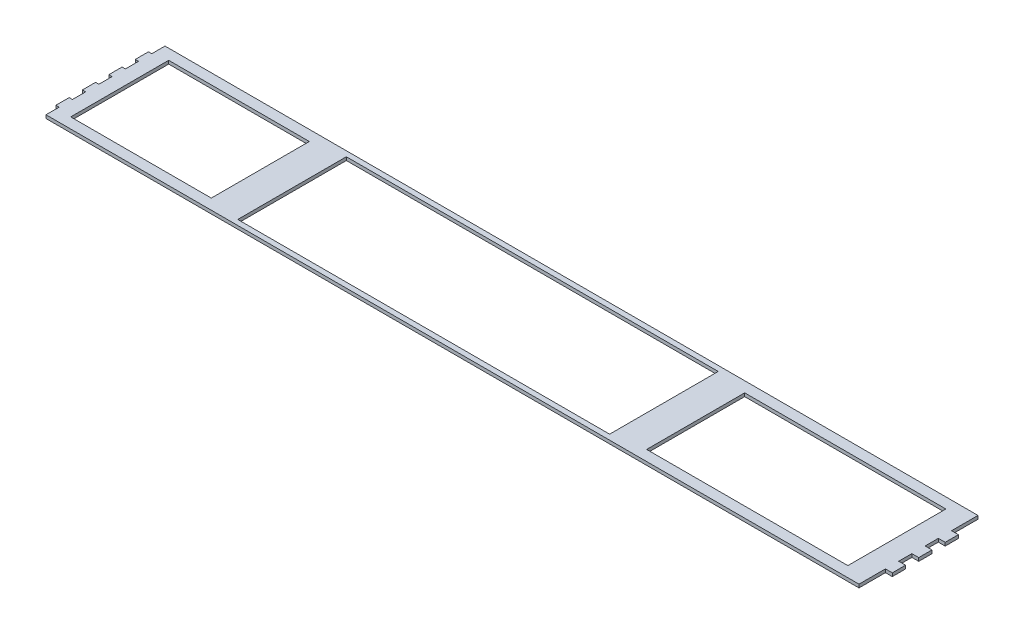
ISO-10303-21;
HEADER;
FILE_DESCRIPTION(('STEP AP214'),'2;1');
FILE_NAME('part.step','',(''),(''),'','','');
FILE_SCHEMA(('AUTOMOTIVE_DESIGN { 1 0 10303 214 1 1 1 1 }'));
ENDSEC;
DATA;
#1=APPLICATION_CONTEXT('core data for automotive mechanical design processes');
#2=APPLICATION_PROTOCOL_DEFINITION('international standard','automotive_design',2000,#1);
#3=PRODUCT_CONTEXT('',#1,'mechanical');
#4=PRODUCT('Part','Part','',(#3));
#5=PRODUCT_RELATED_PRODUCT_CATEGORY('part','',(#4));
#6=PRODUCT_DEFINITION_FORMATION('','',#4);
#7=PRODUCT_DEFINITION_CONTEXT('part definition',#1,'design');
#8=PRODUCT_DEFINITION('design','',#6,#7);
#9=PRODUCT_DEFINITION_SHAPE('','',#8);
#10=(LENGTH_UNIT() NAMED_UNIT(*) SI_UNIT(.MILLI.,.METRE.));
#11=(NAMED_UNIT(*) PLANE_ANGLE_UNIT() SI_UNIT($,.RADIAN.));
#12=(NAMED_UNIT(*) SI_UNIT($,.STERADIAN.) SOLID_ANGLE_UNIT());
#13=UNCERTAINTY_MEASURE_WITH_UNIT(LENGTH_MEASURE(1.E-05),#10,'distance_accuracy_value','');
#14=(GEOMETRIC_REPRESENTATION_CONTEXT(3) GLOBAL_UNCERTAINTY_ASSIGNED_CONTEXT((#13)) GLOBAL_UNIT_ASSIGNED_CONTEXT((#10,
#11,#12)) REPRESENTATION_CONTEXT('',''));
#15=CARTESIAN_POINT('',(0.,0.,0.));
#16=DIRECTION('',(0.,0.,1.));
#17=DIRECTION('',(1.,0.,0.));
#18=AXIS2_PLACEMENT_3D('',#15,#16,#17);
#19=CARTESIAN_POINT('',(0.,51.6603075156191,52.1499998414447));
#20=DIRECTION('',(0.,0.,1.));
#21=DIRECTION('',(1.,0.,0.));
#22=AXIS2_PLACEMENT_3D('',#19,#20,#21);
#23=PLANE('',#22);
#24=DIRECTION('',(0.,1.,0.));
#25=VECTOR('',#24,1.);
#26=CARTESIAN_POINT('',(463.063757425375,-53.8629577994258,52.1500001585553));
#27=LINE('',#26,#25);
#28=CARTESIAN_POINT('',(463.063757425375,53.4853075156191,52.1500001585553));
#29=VERTEX_POINT('',#28);
#30=CARTESIAN_POINT('',(463.063757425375,56.6603075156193,52.1500001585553));
#31=VERTEX_POINT('',#30);
#32=EDGE_CURVE('E1356',#29,#31,#27,.T.);
#33=ORIENTED_EDGE('',*,*,#32,.F.);
#34=DIRECTION('',(1.,0.,0.));
#35=VECTOR('',#34,1.);
#36=CARTESIAN_POINT('',(0.,53.4853075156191,52.1499998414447));
#37=LINE('',#36,#35);
#38=CARTESIAN_POINT('',(105.913757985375,53.4853075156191,52.1499998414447));
#39=VERTEX_POINT('',#38);
#40=EDGE_CURVE('E1636',#39,#29,#37,.T.);
#41=ORIENTED_EDGE('',*,*,#40,.F.);
#42=DIRECTION('',(0.,1.,0.));
#43=VECTOR('',#42,1.);
#44=CARTESIAN_POINT('',(105.913757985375,-53.8629577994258,52.1499998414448));
#45=LINE('',#44,#43);
#46=CARTESIAN_POINT('',(105.913757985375,56.6603075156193,52.1499998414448));
#47=VERTEX_POINT('',#46);
#48=EDGE_CURVE('E1419',#39,#47,#45,.T.);
#49=ORIENTED_EDGE('',*,*,#48,.T.);
#50=DIRECTION('',(-1.,0.,0.));
#51=VECTOR('',#50,1.);
#52=CARTESIAN_POINT('',(-76.4112418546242,56.6603075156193,52.1499998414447));
#53=LINE('',#52,#51);
#54=EDGE_CURVE('E1642',#31,#47,#53,.T.);
#55=ORIENTED_EDGE('',*,*,#54,.F.);
#56=EDGE_LOOP('',(#33,#41,#49,#55));
#57=FACE_BOUND('',#56,.T.);
#58=ADVANCED_FACE('F1065',(#57),#23,.F.);
#59=CARTESIAN_POINT('',(0.,51.6603075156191,-52.1500001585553));
#60=DIRECTION('',(0.,0.,1.));
#61=DIRECTION('',(1.,0.,0.));
#62=AXIS2_PLACEMENT_3D('',#59,#60,#61);
#63=PLANE('',#62);
#64=DIRECTION('',(1.,0.,0.));
#65=VECTOR('',#64,1.);
#66=CARTESIAN_POINT('',(0.,53.4853075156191,-52.1500001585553));
#67=LINE('',#66,#65);
#68=CARTESIAN_POINT('',(105.913757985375,53.4853075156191,-52.1500001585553));
#69=VERTEX_POINT('',#68);
#70=CARTESIAN_POINT('',(463.063757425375,53.4853075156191,-52.1500001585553));
#71=VERTEX_POINT('',#70);
#72=EDGE_CURVE('E1633',#69,#71,#67,.T.);
#73=ORIENTED_EDGE('',*,*,#72,.T.);
#74=DIRECTION('',(0.,1.,0.));
#75=VECTOR('',#74,1.);
#76=CARTESIAN_POINT('',(463.063757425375,-53.8629577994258,-52.1500001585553));
#77=LINE('',#76,#75);
#78=CARTESIAN_POINT('',(463.063757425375,56.6603075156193,-52.1500001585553));
#79=VERTEX_POINT('',#78);
#80=EDGE_CURVE('E1412',#71,#79,#77,.T.);
#81=ORIENTED_EDGE('',*,*,#80,.T.);
#82=DIRECTION('',(-1.,0.,0.));
#83=VECTOR('',#82,1.);
#84=CARTESIAN_POINT('',(-76.4112418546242,56.6603075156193,-52.1500001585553));
#85=LINE('',#84,#83);
#86=CARTESIAN_POINT('',(105.913757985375,56.6603075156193,-52.1500001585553));
#87=VERTEX_POINT('',#86);
#88=EDGE_CURVE('E1639',#79,#87,#85,.T.);
#89=ORIENTED_EDGE('',*,*,#88,.T.);
#90=DIRECTION('',(0.,1.,0.));
#91=VECTOR('',#90,1.);
#92=CARTESIAN_POINT('',(105.913757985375,-53.8629577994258,-52.1500001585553));
#93=LINE('',#92,#91);
#94=EDGE_CURVE('E1421',#69,#87,#93,.T.);
#95=ORIENTED_EDGE('',*,*,#94,.F.);
#96=EDGE_LOOP('',(#73,#81,#89,#95));
#97=FACE_BOUND('',#96,.T.);
#98=ADVANCED_FACE('F1921',(#97),#63,.T.);
#99=CARTESIAN_POINT('',(0.,53.4853075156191,31.7500001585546));
#100=DIRECTION('',(0.,0.,1.));
#101=DIRECTION('',(1.,0.,0.));
#102=AXIS2_PLACEMENT_3D('',#99,#100,#101);
#103=PLANE('',#102);
#104=DIRECTION('',(-1.,0.,0.));
#105=VECTOR('',#104,1.);
#106=CARTESIAN_POINT('',(-76.4112418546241,56.6603075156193,31.7500001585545));
#107=LINE('',#106,#105);
#108=CARTESIAN_POINT('',(714.140524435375,56.6603075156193,31.7500001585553));
#109=VERTEX_POINT('',#108);
#110=CARTESIAN_POINT('',(707.550474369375,56.6603075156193,31.7500001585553));
#111=VERTEX_POINT('',#110);
#112=EDGE_CURVE('E1564',#109,#111,#107,.T.);
#113=ORIENTED_EDGE('',*,*,#112,.T.);
#114=DIRECTION('',(0.,1.,0.));
#115=VECTOR('',#114,1.);
#116=CARTESIAN_POINT('',(707.550474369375,53.4853075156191,31.7500001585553));
#117=LINE('',#116,#115);
#118=CARTESIAN_POINT('',(707.550474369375,53.4853075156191,31.7500001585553));
#119=VERTEX_POINT('',#118);
#120=EDGE_CURVE('E1475',#119,#111,#117,.T.);
#121=ORIENTED_EDGE('',*,*,#120,.F.);
#122=DIRECTION('',(1.,0.,0.));
#123=VECTOR('',#122,1.);
#124=CARTESIAN_POINT('',(0.,53.4853075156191,31.7500001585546));
#125=LINE('',#124,#123);
#126=CARTESIAN_POINT('',(714.140524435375,53.4853075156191,31.7500001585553));
#127=VERTEX_POINT('',#126);
#128=EDGE_CURVE('E1462',#119,#127,#125,.T.);
#129=ORIENTED_EDGE('',*,*,#128,.T.);
#130=DIRECTION('',(0.,1.,0.));
#131=VECTOR('',#130,1.);
#132=CARTESIAN_POINT('',(714.140524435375,53.4853075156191,31.7500001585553));
#133=LINE('',#132,#131);
#134=EDGE_CURVE('E1479',#127,#109,#133,.T.);
#135=ORIENTED_EDGE('',*,*,#134,.T.);
#136=EDGE_LOOP('',(#113,#121,#129,#135));
#137=FACE_BOUND('',#136,.T.);
#138=ADVANCED_FACE('F1879',(#137),#103,.T.);
#139=CARTESIAN_POINT('',(714.140524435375,53.4853075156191,0.));
#140=DIRECTION('',(-1.,0.,0.));
#141=DIRECTION('',(0.,0.,1.));
#142=AXIS2_PLACEMENT_3D('',#139,#140,#141);
#143=PLANE('',#142);
#144=ORIENTED_EDGE('',*,*,#134,.F.);
#145=DIRECTION('',(0.,0.,1.));
#146=VECTOR('',#145,1.);
#147=CARTESIAN_POINT('',(714.140524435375,53.4853075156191,0.));
#148=LINE('',#147,#146);
#149=CARTESIAN_POINT('',(714.140524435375,53.4853075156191,19.0500000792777));
#150=VERTEX_POINT('',#149);
#151=EDGE_CURVE('E1439',#150,#127,#148,.T.);
#152=ORIENTED_EDGE('',*,*,#151,.F.);
#153=DIRECTION('',(0.,1.,0.));
#154=VECTOR('',#153,1.);
#155=CARTESIAN_POINT('',(714.140524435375,53.4853075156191,19.0500000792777));
#156=LINE('',#155,#154);
#157=CARTESIAN_POINT('',(714.140524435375,56.6603075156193,19.0500000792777));
#158=VERTEX_POINT('',#157);
#159=EDGE_CURVE('E1483',#150,#158,#156,.T.);
#160=ORIENTED_EDGE('',*,*,#159,.T.);
#161=DIRECTION('',(0.,0.,-1.));
#162=VECTOR('',#161,1.);
#163=CARTESIAN_POINT('',(714.140524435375,56.6603075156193,57.1499998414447));
#164=LINE('',#163,#162);
#165=EDGE_CURVE('E1560',#109,#158,#164,.T.);
#166=ORIENTED_EDGE('',*,*,#165,.F.);
#167=EDGE_LOOP('',(#144,#152,#160,#166));
#168=FACE_BOUND('',#167,.T.);
#169=ADVANCED_FACE('F1876',(#168),#143,.F.);
#170=CARTESIAN_POINT('',(0.,53.4853075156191,19.0500000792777));
#171=DIRECTION('',(0.,0.,1.));
#172=DIRECTION('',(1.,0.,0.));
#173=AXIS2_PLACEMENT_3D('',#170,#171,#172);
#174=PLANE('',#173);
#175=ORIENTED_EDGE('',*,*,#159,.F.);
#176=DIRECTION('',(1.,0.,0.));
#177=VECTOR('',#176,1.);
#178=CARTESIAN_POINT('',(0.,53.4853075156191,19.0500000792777));
#179=LINE('',#178,#177);
#180=CARTESIAN_POINT('',(707.550474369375,53.4853075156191,19.0500000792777));
#181=VERTEX_POINT('',#180);
#182=EDGE_CURVE('E1458',#181,#150,#179,.T.);
#183=ORIENTED_EDGE('',*,*,#182,.F.);
#184=DIRECTION('',(0.,1.,0.));
#185=VECTOR('',#184,1.);
#186=CARTESIAN_POINT('',(707.550474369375,53.4853075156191,19.0500000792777));
#187=LINE('',#186,#185);
#188=CARTESIAN_POINT('',(707.550474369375,56.6603075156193,19.0500000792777));
#189=VERTEX_POINT('',#188);
#190=EDGE_CURVE('E1487',#181,#189,#187,.T.);
#191=ORIENTED_EDGE('',*,*,#190,.T.);
#192=DIRECTION('',(-1.,0.,0.));
#193=VECTOR('',#192,1.);
#194=CARTESIAN_POINT('',(-76.4112418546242,56.6603075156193,19.0500000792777));
#195=LINE('',#194,#193);
#196=EDGE_CURVE('E1556',#158,#189,#195,.T.);
#197=ORIENTED_EDGE('',*,*,#196,.F.);
#198=EDGE_LOOP('',(#175,#183,#191,#197));
#199=FACE_BOUND('',#198,.T.);
#200=ADVANCED_FACE('F2096',(#199),#174,.F.);
#201=CARTESIAN_POINT('',(707.550474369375,53.4853075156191,0.));
#202=DIRECTION('',(-1.,0.,0.));
#203=DIRECTION('',(0.,0.,1.));
#204=AXIS2_PLACEMENT_3D('',#201,#202,#203);
#205=PLANE('',#204);
#206=ORIENTED_EDGE('',*,*,#190,.F.);
#207=DIRECTION('',(0.,0.,1.));
#208=VECTOR('',#207,1.);
#209=CARTESIAN_POINT('',(707.550474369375,53.4853075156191,0.));
#210=LINE('',#209,#208);
#211=CARTESIAN_POINT('',(707.550474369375,53.4853075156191,6.35));
#212=VERTEX_POINT('',#211);
#213=EDGE_CURVE('E1454',#212,#181,#210,.T.);
#214=ORIENTED_EDGE('',*,*,#213,.F.);
#215=DIRECTION('',(0.,1.,0.));
#216=VECTOR('',#215,1.);
#217=CARTESIAN_POINT('',(707.550474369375,53.4853075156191,6.35));
#218=LINE('',#217,#216);
#219=CARTESIAN_POINT('',(707.550474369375,56.6603075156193,6.35));
#220=VERTEX_POINT('',#219);
#221=EDGE_CURVE('E1491',#212,#220,#218,.T.);
#222=ORIENTED_EDGE('',*,*,#221,.T.);
#223=DIRECTION('',(0.,0.,-1.));
#224=VECTOR('',#223,1.);
#225=CARTESIAN_POINT('',(707.550474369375,56.6603075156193,57.1499998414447));
#226=LINE('',#225,#224);
#227=EDGE_CURVE('E1552',#189,#220,#226,.T.);
#228=ORIENTED_EDGE('',*,*,#227,.F.);
#229=EDGE_LOOP('',(#206,#214,#222,#228));
#230=FACE_BOUND('',#229,.T.);
#231=ADVANCED_FACE('F2106',(#230),#205,.F.);
#232=CARTESIAN_POINT('',(0.,53.4853075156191,6.35));
#233=DIRECTION('',(0.,0.,1.));
#234=DIRECTION('',(1.,0.,0.));
#235=AXIS2_PLACEMENT_3D('',#232,#233,#234);
#236=PLANE('',#235);
#237=DIRECTION('',(-1.,0.,0.));
#238=VECTOR('',#237,1.);
#239=CARTESIAN_POINT('',(-76.4112418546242,56.6603075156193,6.34999999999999));
#240=LINE('',#239,#238);
#241=CARTESIAN_POINT('',(714.140524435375,56.6603075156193,6.35));
#242=VERTEX_POINT('',#241);
#243=EDGE_CURVE('E1549',#242,#220,#240,.T.);
#244=ORIENTED_EDGE('',*,*,#243,.T.);
#245=ORIENTED_EDGE('',*,*,#221,.F.);
#246=DIRECTION('',(1.,0.,0.));
#247=VECTOR('',#246,1.);
#248=CARTESIAN_POINT('',(0.,53.4853075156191,6.35));
#249=LINE('',#248,#247);
#250=CARTESIAN_POINT('',(714.140524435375,53.4853075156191,6.35));
#251=VERTEX_POINT('',#250);
#252=EDGE_CURVE('E1451',#212,#251,#249,.T.);
#253=ORIENTED_EDGE('',*,*,#252,.T.);
#254=DIRECTION('',(0.,1.,0.));
#255=VECTOR('',#254,1.);
#256=CARTESIAN_POINT('',(714.140524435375,53.4853075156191,6.35));
#257=LINE('',#256,#255);
#258=EDGE_CURVE('E1495',#251,#242,#257,.T.);
#259=ORIENTED_EDGE('',*,*,#258,.T.);
#260=EDGE_LOOP('',(#244,#245,#253,#259));
#261=FACE_BOUND('',#260,.T.);
#262=ADVANCED_FACE('F2114',(#261),#236,.T.);
#263=ORIENTED_EDGE('',*,*,#258,.F.);
#264=CARTESIAN_POINT('',(714.140524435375,53.4853075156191,-6.35000007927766));
#265=VERTEX_POINT('',#264);
#266=EDGE_CURVE('E1440',#265,#251,#148,.T.);
#267=ORIENTED_EDGE('',*,*,#266,.F.);
#268=DIRECTION('',(0.,1.,0.));
#269=VECTOR('',#268,1.);
#270=CARTESIAN_POINT('',(714.140524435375,53.4853075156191,-6.35000007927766));
#271=LINE('',#270,#269);
#272=CARTESIAN_POINT('',(714.140524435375,56.6603075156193,-6.35000007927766));
#273=VERTEX_POINT('',#272);
#274=EDGE_CURVE('E1499',#265,#273,#271,.T.);
#275=ORIENTED_EDGE('',*,*,#274,.T.);
#276=DIRECTION('',(0.,0.,-1.));
#277=VECTOR('',#276,1.);
#278=CARTESIAN_POINT('',(714.140524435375,56.6603075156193,57.1499998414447));
#279=LINE('',#278,#277);
#280=EDGE_CURVE('E1545',#242,#273,#279,.T.);
#281=ORIENTED_EDGE('',*,*,#280,.F.);
#282=EDGE_LOOP('',(#263,#267,#275,#281));
#283=FACE_BOUND('',#282,.T.);
#284=ADVANCED_FACE('F2098',(#283),#143,.F.);
#285=CARTESIAN_POINT('',(0.,53.4853075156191,-6.35000007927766));
#286=DIRECTION('',(0.,0.,1.));
#287=DIRECTION('',(1.,0.,0.));
#288=AXIS2_PLACEMENT_3D('',#285,#286,#287);
#289=PLANE('',#288);
#290=ORIENTED_EDGE('',*,*,#274,.F.);
#291=DIRECTION('',(1.,0.,0.));
#292=VECTOR('',#291,1.);
#293=CARTESIAN_POINT('',(0.,53.4853075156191,-6.35000007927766));
#294=LINE('',#293,#292);
#295=CARTESIAN_POINT('',(707.550474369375,53.4853075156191,-6.35000007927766));
#296=VERTEX_POINT('',#295);
#297=EDGE_CURVE('E1447',#296,#265,#294,.T.);
#298=ORIENTED_EDGE('',*,*,#297,.F.);
#299=DIRECTION('',(0.,1.,0.));
#300=VECTOR('',#299,1.);
#301=CARTESIAN_POINT('',(707.550474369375,53.4853075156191,-6.35000007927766));
#302=LINE('',#301,#300);
#303=CARTESIAN_POINT('',(707.550474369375,56.6603075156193,-6.35000007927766));
#304=VERTEX_POINT('',#303);
#305=EDGE_CURVE('E1503',#296,#304,#302,.T.);
#306=ORIENTED_EDGE('',*,*,#305,.T.);
#307=DIRECTION('',(-1.,0.,0.));
#308=VECTOR('',#307,1.);
#309=CARTESIAN_POINT('',(-76.4112418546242,56.6603075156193,-6.35000007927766));
#310=LINE('',#309,#308);
#311=EDGE_CURVE('E1541',#273,#304,#310,.T.);
#312=ORIENTED_EDGE('',*,*,#311,.F.);
#313=EDGE_LOOP('',(#290,#298,#306,#312));
#314=FACE_BOUND('',#313,.T.);
#315=ADVANCED_FACE('F1860',(#314),#289,.F.);
#316=CARTESIAN_POINT('',(707.550474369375,53.4853075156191,0.));
#317=DIRECTION('',(-1.,0.,0.));
#318=DIRECTION('',(0.,0.,1.));
#319=AXIS2_PLACEMENT_3D('',#316,#317,#318);
#320=PLANE('',#319);
#321=ORIENTED_EDGE('',*,*,#305,.F.);
#322=DIRECTION('',(0.,0.,1.));
#323=VECTOR('',#322,1.);
#324=CARTESIAN_POINT('',(707.550474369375,53.4853075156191,0.));
#325=LINE('',#324,#323);
#326=CARTESIAN_POINT('',(707.550474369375,53.4853075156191,-19.0500001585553));
#327=VERTEX_POINT('',#326);
#328=EDGE_CURVE('E1443',#327,#296,#325,.T.);
#329=ORIENTED_EDGE('',*,*,#328,.F.);
#330=DIRECTION('',(0.,1.,0.));
#331=VECTOR('',#330,1.);
#332=CARTESIAN_POINT('',(707.550474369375,53.4853075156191,-19.0500001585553));
#333=LINE('',#332,#331);
#334=CARTESIAN_POINT('',(707.550474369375,56.6603075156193,-19.0500001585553));
#335=VERTEX_POINT('',#334);
#336=EDGE_CURVE('E1507',#327,#335,#333,.T.);
#337=ORIENTED_EDGE('',*,*,#336,.T.);
#338=DIRECTION('',(0.,0.,-1.));
#339=VECTOR('',#338,1.);
#340=CARTESIAN_POINT('',(707.550474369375,56.6603075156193,57.1499998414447));
#341=LINE('',#340,#339);
#342=EDGE_CURVE('E1537',#304,#335,#341,.T.);
#343=ORIENTED_EDGE('',*,*,#342,.F.);
#344=EDGE_LOOP('',(#321,#329,#337,#343));
#345=FACE_BOUND('',#344,.T.);
#346=ADVANCED_FACE('F1857',(#345),#320,.F.);
#347=CARTESIAN_POINT('',(0.,53.4853075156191,-19.0500001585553));
#348=DIRECTION('',(0.,0.,1.));
#349=DIRECTION('',(1.,0.,0.));
#350=AXIS2_PLACEMENT_3D('',#347,#348,#349);
#351=PLANE('',#350);
#352=DIRECTION('',(-1.,0.,0.));
#353=VECTOR('',#352,1.);
#354=CARTESIAN_POINT('',(-76.4112418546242,56.6603075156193,-19.0500001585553));
#355=LINE('',#354,#353);
#356=CARTESIAN_POINT('',(714.140524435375,56.6603075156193,-19.0500001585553));
#357=VERTEX_POINT('',#356);
#358=EDGE_CURVE('E1534',#357,#335,#355,.T.);
#359=ORIENTED_EDGE('',*,*,#358,.T.);
#360=ORIENTED_EDGE('',*,*,#336,.F.);
#361=DIRECTION('',(1.,0.,0.));
#362=VECTOR('',#361,1.);
#363=CARTESIAN_POINT('',(0.,53.4853075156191,-19.0500001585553));
#364=LINE('',#363,#362);
#365=CARTESIAN_POINT('',(714.140524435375,53.4853075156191,-19.0500001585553));
#366=VERTEX_POINT('',#365);
#367=EDGE_CURVE('E1438',#327,#366,#364,.T.);
#368=ORIENTED_EDGE('',*,*,#367,.T.);
#369=DIRECTION('',(0.,1.,0.));
#370=VECTOR('',#369,1.);
#371=CARTESIAN_POINT('',(714.140524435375,53.4853075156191,-19.0500001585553));
#372=LINE('',#371,#370);
#373=EDGE_CURVE('E1511',#366,#357,#372,.T.);
#374=ORIENTED_EDGE('',*,*,#373,.T.);
#375=EDGE_LOOP('',(#359,#360,#368,#374));
#376=FACE_BOUND('',#375,.T.);
#377=ADVANCED_FACE('F1855',(#376),#351,.T.);
#378=ORIENTED_EDGE('',*,*,#373,.F.);
#379=CARTESIAN_POINT('',(714.140524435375,53.4853075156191,-31.7500001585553));
#380=VERTEX_POINT('',#379);
#381=EDGE_CURVE('E1434',#380,#366,#148,.T.);
#382=ORIENTED_EDGE('',*,*,#381,.F.);
#383=DIRECTION('',(0.,1.,0.));
#384=VECTOR('',#383,1.);
#385=CARTESIAN_POINT('',(714.140524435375,53.4853075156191,-31.7500001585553));
#386=LINE('',#385,#384);
#387=CARTESIAN_POINT('',(714.140524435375,56.6603075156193,-31.7500001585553));
#388=VERTEX_POINT('',#387);
#389=EDGE_CURVE('E1515',#380,#388,#386,.T.);
#390=ORIENTED_EDGE('',*,*,#389,.T.);
#391=DIRECTION('',(0.,0.,-1.));
#392=VECTOR('',#391,1.);
#393=CARTESIAN_POINT('',(714.140524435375,56.6603075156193,57.1499998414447));
#394=LINE('',#393,#392);
#395=EDGE_CURVE('E1530',#357,#388,#394,.T.);
#396=ORIENTED_EDGE('',*,*,#395,.F.);
#397=EDGE_LOOP('',(#378,#382,#390,#396));
#398=FACE_BOUND('',#397,.T.);
#399=ADVANCED_FACE('F1851',(#398),#143,.F.);
#400=CARTESIAN_POINT('',(0.,53.4853075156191,-31.7500001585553));
#401=DIRECTION('',(0.,0.,-1.));
#402=DIRECTION('',(-1.,0.,0.));
#403=AXIS2_PLACEMENT_3D('',#400,#401,#402);
#404=PLANE('',#403);
#405=DIRECTION('',(1.,0.,0.));
#406=VECTOR('',#405,1.);
#407=CARTESIAN_POINT('',(-76.4112418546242,56.6603075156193,-31.7500001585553));
#408=LINE('',#407,#406);
#409=CARTESIAN_POINT('',(707.550474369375,56.6603075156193,-31.7500001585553));
#410=VERTEX_POINT('',#409);
#411=EDGE_CURVE('E1527',#410,#388,#408,.T.);
#412=ORIENTED_EDGE('',*,*,#411,.T.);
#413=ORIENTED_EDGE('',*,*,#389,.F.);
#414=DIRECTION('',(-1.,0.,0.));
#415=VECTOR('',#414,1.);
#416=CARTESIAN_POINT('',(0.,53.4853075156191,-31.7500001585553));
#417=LINE('',#416,#415);
#418=CARTESIAN_POINT('',(707.550474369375,53.4853075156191,-31.7500001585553));
#419=VERTEX_POINT('',#418);
#420=EDGE_CURVE('E1430',#380,#419,#417,.T.);
#421=ORIENTED_EDGE('',*,*,#420,.T.);
#422=DIRECTION('',(0.,1.,0.));
#423=VECTOR('',#422,1.);
#424=CARTESIAN_POINT('',(707.550474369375,53.4853075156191,-31.7500001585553));
#425=LINE('',#424,#423);
#426=EDGE_CURVE('E1519',#419,#410,#425,.T.);
#427=ORIENTED_EDGE('',*,*,#426,.T.);
#428=EDGE_LOOP('',(#412,#413,#421,#427));
#429=FACE_BOUND('',#428,.T.);
#430=ADVANCED_FACE('F1847',(#429),#404,.T.);
#431=CARTESIAN_POINT('',(707.550474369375,53.4853075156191,0.));
#432=DIRECTION('',(1.,0.,0.));
#433=DIRECTION('',(0.,0.,-1.));
#434=AXIS2_PLACEMENT_3D('',#431,#432,#433);
#435=PLANE('',#434);
#436=DIRECTION('',(0.,0.,1.));
#437=VECTOR('',#436,1.);
#438=CARTESIAN_POINT('',(707.550474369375,56.6603075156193,57.1499998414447));
#439=LINE('',#438,#437);
#440=CARTESIAN_POINT('',(707.550474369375,56.6603075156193,-57.1500001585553));
#441=VERTEX_POINT('',#440);
#442=EDGE_CURVE('E1474',#441,#410,#439,.T.);
#443=ORIENTED_EDGE('',*,*,#442,.T.);
#444=ORIENTED_EDGE('',*,*,#426,.F.);
#445=DIRECTION('',(0.,0.,-1.));
#446=VECTOR('',#445,1.);
#447=CARTESIAN_POINT('',(707.550474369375,53.4853075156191,0.));
#448=LINE('',#447,#446);
#449=CARTESIAN_POINT('',(707.550474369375,53.4853075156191,-57.1500001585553));
#450=VERTEX_POINT('',#449);
#451=EDGE_CURVE('E1427',#419,#450,#448,.T.);
#452=ORIENTED_EDGE('',*,*,#451,.T.);
#453=DIRECTION('',(0.,1.,0.));
#454=VECTOR('',#453,1.);
#455=CARTESIAN_POINT('',(707.550474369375,53.4853075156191,-57.1500001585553));
#456=LINE('',#455,#454);
#457=EDGE_CURVE('E1469',#450,#441,#456,.T.);
#458=ORIENTED_EDGE('',*,*,#457,.T.);
#459=EDGE_LOOP('',(#443,#444,#452,#458));
#460=FACE_BOUND('',#459,.T.);
#461=ADVANCED_FACE('F1843',(#460),#435,.T.);
#462=CARTESIAN_POINT('',(-76.4112418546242,-0.48969248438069,-57.1500001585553));
#463=DIRECTION('',(0.,0.,-1.));
#464=DIRECTION('',(-1.,0.,0.));
#465=AXIS2_PLACEMENT_3D('',#462,#463,#464);
#466=PLANE('',#465);
#467=DIRECTION('',(-1.,0.,0.));
#468=VECTOR('',#467,1.);
#469=CARTESIAN_POINT('',(-76.4112418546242,56.6603075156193,-57.1500001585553));
#470=LINE('',#469,#468);
#471=CARTESIAN_POINT('',(-73.2362418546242,56.6603075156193,-57.1500001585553));
#472=VERTEX_POINT('',#471);
#473=EDGE_CURVE('E1753',#441,#472,#470,.T.);
#474=ORIENTED_EDGE('',*,*,#473,.F.);
#475=ORIENTED_EDGE('',*,*,#457,.F.);
#476=DIRECTION('',(-1.,0.,0.));
#477=VECTOR('',#476,1.);
#478=CARTESIAN_POINT('',(-76.4112418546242,53.4853075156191,-57.1500001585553));
#479=LINE('',#478,#477);
#480=CARTESIAN_POINT('',(-73.2362418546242,53.4853075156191,-57.1500001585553));
#481=VERTEX_POINT('',#480);
#482=EDGE_CURVE('E1571',#450,#481,#479,.T.);
#483=ORIENTED_EDGE('',*,*,#482,.T.);
#484=DIRECTION('',(0.,1.,0.));
#485=VECTOR('',#484,1.);
#486=CARTESIAN_POINT('',(-73.2362418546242,51.6603075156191,-57.1500001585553));
#487=LINE('',#486,#485);
#488=EDGE_CURVE('E1646',#481,#472,#487,.T.);
#489=ORIENTED_EDGE('',*,*,#488,.T.);
#490=EDGE_LOOP('',(#474,#475,#483,#489));
#491=FACE_BOUND('',#490,.T.);
#492=ADVANCED_FACE('F1840',(#491),#466,.T.);
#493=CARTESIAN_POINT('',(-73.2362418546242,51.6603075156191,0.));
#494=DIRECTION('',(1.,0.,0.));
#495=DIRECTION('',(0.,0.,-1.));
#496=AXIS2_PLACEMENT_3D('',#493,#494,#495);
#497=PLANE('',#496);
#498=DIRECTION('',(0.,0.,-1.));
#499=VECTOR('',#498,1.);
#500=CARTESIAN_POINT('',(-73.2362418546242,53.4853075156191,0.));
#501=LINE('',#500,#499);
#502=CARTESIAN_POINT('',(-73.2362418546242,53.4853075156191,-44.4500001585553));
#503=VERTEX_POINT('',#502);
#504=EDGE_CURVE('E1574',#503,#481,#501,.T.);
#505=ORIENTED_EDGE('',*,*,#504,.F.);
#506=DIRECTION('',(0.,1.,0.));
#507=VECTOR('',#506,1.);
#508=CARTESIAN_POINT('',(-73.2362418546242,51.6603075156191,-44.4500001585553));
#509=LINE('',#508,#507);
#510=CARTESIAN_POINT('',(-73.2362418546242,56.6603075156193,-44.4500001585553));
#511=VERTEX_POINT('',#510);
#512=EDGE_CURVE('E1651',#503,#511,#509,.T.);
#513=ORIENTED_EDGE('',*,*,#512,.T.);
#514=DIRECTION('',(0.,0.,1.));
#515=VECTOR('',#514,1.);
#516=CARTESIAN_POINT('',(-73.2362418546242,56.6603075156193,57.1499998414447));
#517=LINE('',#516,#515);
#518=EDGE_CURVE('E1749',#472,#511,#517,.T.);
#519=ORIENTED_EDGE('',*,*,#518,.F.);
#520=ORIENTED_EDGE('',*,*,#488,.F.);
#521=EDGE_LOOP('',(#505,#513,#519,#520));
#522=FACE_BOUND('',#521,.T.);
#523=ADVANCED_FACE('F1832',(#522),#497,.F.);
#524=CARTESIAN_POINT('',(1.94289030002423E-13,51.6603075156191,-44.450000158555));
#525=DIRECTION('',(0.,0.,1.));
#526=DIRECTION('',(1.,0.,0.));
#527=AXIS2_PLACEMENT_3D('',#524,#525,#526);
#528=PLANE('',#527);
#529=DIRECTION('',(1.,0.,0.));
#530=VECTOR('',#529,1.);
#531=CARTESIAN_POINT('',(1.94289030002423E-13,53.4853075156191,-44.450000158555));
#532=LINE('',#531,#530);
#533=CARTESIAN_POINT('',(-76.4112418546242,53.4853075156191,-44.4500001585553));
#534=VERTEX_POINT('',#533);
#535=EDGE_CURVE('E1578',#534,#503,#532,.T.);
#536=ORIENTED_EDGE('',*,*,#535,.F.);
#537=DIRECTION('',(0.,1.,0.));
#538=VECTOR('',#537,1.);
#539=CARTESIAN_POINT('',(-76.4112418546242,51.6603075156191,-44.4500001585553));
#540=LINE('',#539,#538);
#541=CARTESIAN_POINT('',(-76.4112418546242,56.6603075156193,-44.4500001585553));
#542=VERTEX_POINT('',#541);
#543=EDGE_CURVE('E1654',#534,#542,#540,.T.);
#544=ORIENTED_EDGE('',*,*,#543,.T.);
#545=DIRECTION('',(-1.,0.,0.));
#546=VECTOR('',#545,1.);
#547=CARTESIAN_POINT('',(-76.4112418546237,56.6603075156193,-44.4500001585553));
#548=LINE('',#547,#546);
#549=EDGE_CURVE('E1745',#511,#542,#548,.T.);
#550=ORIENTED_EDGE('',*,*,#549,.F.);
#551=ORIENTED_EDGE('',*,*,#512,.F.);
#552=EDGE_LOOP('',(#536,#544,#550,#551));
#553=FACE_BOUND('',#552,.T.);
#554=ADVANCED_FACE('F1828',(#553),#528,.F.);
#555=CARTESIAN_POINT('',(-76.4112418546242,-57.6396924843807,57.1499998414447));
#556=DIRECTION('',(1.,0.,0.));
#557=DIRECTION('',(0.,0.,-1.));
#558=AXIS2_PLACEMENT_3D('',#555,#556,#557);
#559=PLANE('',#558);
#560=DIRECTION('',(0.,0.,-1.));
#561=VECTOR('',#560,1.);
#562=CARTESIAN_POINT('',(-76.4112418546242,53.4853075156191,57.1499998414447));
#563=LINE('',#562,#561);
#564=CARTESIAN_POINT('',(-76.4112418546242,53.4853075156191,-31.7500001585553));
#565=VERTEX_POINT('',#564);
#566=EDGE_CURVE('E1581',#565,#534,#563,.T.);
#567=ORIENTED_EDGE('',*,*,#566,.F.);
#568=DIRECTION('',(0.,1.,0.));
#569=VECTOR('',#568,1.);
#570=CARTESIAN_POINT('',(-76.4112418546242,51.6603075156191,-31.7500001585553));
#571=LINE('',#570,#569);
#572=CARTESIAN_POINT('',(-76.4112418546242,56.6603075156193,-31.7500001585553));
#573=VERTEX_POINT('',#572);
#574=EDGE_CURVE('E1666',#565,#573,#571,.T.);
#575=ORIENTED_EDGE('',*,*,#574,.T.);
#576=DIRECTION('',(0.,0.,-1.));
#577=VECTOR('',#576,1.);
#578=CARTESIAN_POINT('',(-76.4112418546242,56.6603075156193,57.1499998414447));
#579=LINE('',#578,#577);
#580=EDGE_CURVE('E1757',#573,#542,#579,.T.);
#581=ORIENTED_EDGE('',*,*,#580,.T.);
#582=ORIENTED_EDGE('',*,*,#543,.F.);
#583=EDGE_LOOP('',(#567,#575,#581,#582));
#584=FACE_BOUND('',#583,.T.);
#585=ADVANCED_FACE('F1823',(#584),#559,.F.);
#586=CARTESIAN_POINT('',(0.,51.6603075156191,-31.7500001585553));
#587=DIRECTION('',(0.,0.,1.));
#588=DIRECTION('',(1.,0.,0.));
#589=AXIS2_PLACEMENT_3D('',#586,#587,#588);
#590=PLANE('',#589);
#591=ORIENTED_EDGE('',*,*,#574,.F.);
#592=DIRECTION('',(1.,0.,0.));
#593=VECTOR('',#592,1.);
#594=CARTESIAN_POINT('',(0.,53.4853075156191,-31.7500001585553));
#595=LINE('',#594,#593);
#596=CARTESIAN_POINT('',(-73.2362418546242,53.4853075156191,-31.7500001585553));
#597=VERTEX_POINT('',#596);
#598=EDGE_CURVE('E1584',#565,#597,#595,.T.);
#599=ORIENTED_EDGE('',*,*,#598,.T.);
#600=DIRECTION('',(0.,1.,0.));
#601=VECTOR('',#600,1.);
#602=CARTESIAN_POINT('',(-73.2362418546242,51.6603075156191,-31.7500001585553));
#603=LINE('',#602,#601);
#604=CARTESIAN_POINT('',(-73.2362418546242,56.6603075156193,-31.7500001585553));
#605=VERTEX_POINT('',#604);
#606=EDGE_CURVE('E1657',#597,#605,#603,.T.);
#607=ORIENTED_EDGE('',*,*,#606,.T.);
#608=DIRECTION('',(-1.,0.,0.));
#609=VECTOR('',#608,1.);
#610=CARTESIAN_POINT('',(-76.4112418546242,56.6603075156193,-31.7500001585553));
#611=LINE('',#610,#609);
#612=EDGE_CURVE('E1741',#605,#573,#611,.T.);
#613=ORIENTED_EDGE('',*,*,#612,.T.);
#614=EDGE_LOOP('',(#591,#599,#607,#613));
#615=FACE_BOUND('',#614,.T.);
#616=ADVANCED_FACE('F1822',(#615),#590,.T.);
#617=CARTESIAN_POINT('',(-73.2362418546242,51.6603075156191,0.));
#618=DIRECTION('',(1.,0.,0.));
#619=DIRECTION('',(0.,0.,-1.));
#620=AXIS2_PLACEMENT_3D('',#617,#618,#619);
#621=PLANE('',#620);
#622=DIRECTION('',(0.,0.,-1.));
#623=VECTOR('',#622,1.);
#624=CARTESIAN_POINT('',(-73.2362418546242,53.4853075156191,0.));
#625=LINE('',#624,#623);
#626=CARTESIAN_POINT('',(-73.2362418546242,53.4853075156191,-19.0500001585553));
#627=VERTEX_POINT('',#626);
#628=EDGE_CURVE('E1591',#627,#597,#625,.T.);
#629=ORIENTED_EDGE('',*,*,#628,.F.);
#630=DIRECTION('',(0.,1.,0.));
#631=VECTOR('',#630,1.);
#632=CARTESIAN_POINT('',(-73.2362418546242,51.6603075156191,-19.0500001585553));
#633=LINE('',#632,#631);
#634=CARTESIAN_POINT('',(-73.2362418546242,56.6603075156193,-19.0500001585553));
#635=VERTEX_POINT('',#634);
#636=EDGE_CURVE('E1660',#627,#635,#633,.T.);
#637=ORIENTED_EDGE('',*,*,#636,.T.);
#638=DIRECTION('',(0.,0.,1.));
#639=VECTOR('',#638,1.);
#640=CARTESIAN_POINT('',(-73.2362418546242,56.6603075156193,57.1499998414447));
#641=LINE('',#640,#639);
#642=EDGE_CURVE('E1737',#605,#635,#641,.T.);
#643=ORIENTED_EDGE('',*,*,#642,.F.);
#644=ORIENTED_EDGE('',*,*,#606,.F.);
#645=EDGE_LOOP('',(#629,#637,#643,#644));
#646=FACE_BOUND('',#645,.T.);
#647=ADVANCED_FACE('F1818',(#646),#621,.F.);
#648=CARTESIAN_POINT('',(0.,51.6603075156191,-19.0500001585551));
#649=DIRECTION('',(0.,0.,1.));
#650=DIRECTION('',(1.,0.,0.));
#651=AXIS2_PLACEMENT_3D('',#648,#649,#650);
#652=PLANE('',#651);
#653=DIRECTION('',(1.,0.,0.));
#654=VECTOR('',#653,1.);
#655=CARTESIAN_POINT('',(0.,53.4853075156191,-19.0500001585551));
#656=LINE('',#655,#654);
#657=CARTESIAN_POINT('',(-76.4112418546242,53.4853075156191,-19.0500001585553));
#658=VERTEX_POINT('',#657);
#659=EDGE_CURVE('E1604',#658,#627,#656,.T.);
#660=ORIENTED_EDGE('',*,*,#659,.F.);
#661=DIRECTION('',(0.,1.,0.));
#662=VECTOR('',#661,1.);
#663=CARTESIAN_POINT('',(-76.4112418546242,51.6603075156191,-19.0500001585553));
#664=LINE('',#663,#662);
#665=CARTESIAN_POINT('',(-76.4112418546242,56.6603075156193,-19.0500001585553));
#666=VERTEX_POINT('',#665);
#667=EDGE_CURVE('E1663',#658,#666,#664,.T.);
#668=ORIENTED_EDGE('',*,*,#667,.T.);
#669=DIRECTION('',(-1.,0.,0.));
#670=VECTOR('',#669,1.);
#671=CARTESIAN_POINT('',(-76.411241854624,56.6603075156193,-19.0500001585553));
#672=LINE('',#671,#670);
#673=EDGE_CURVE('E1733',#635,#666,#672,.T.);
#674=ORIENTED_EDGE('',*,*,#673,.F.);
#675=ORIENTED_EDGE('',*,*,#636,.F.);
#676=EDGE_LOOP('',(#660,#668,#674,#675));
#677=FACE_BOUND('',#676,.T.);
#678=ADVANCED_FACE('F1811',(#677),#652,.F.);
#679=DIRECTION('',(0.,0.,-1.));
#680=VECTOR('',#679,1.);
#681=CARTESIAN_POINT('',(-76.4112418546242,53.4853075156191,57.1499998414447));
#682=LINE('',#681,#680);
#683=CARTESIAN_POINT('',(-76.4112418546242,53.4853075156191,-6.34999999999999));
#684=VERTEX_POINT('',#683);
#685=EDGE_CURVE('E1620',#684,#658,#682,.T.);
#686=ORIENTED_EDGE('',*,*,#685,.F.);
#687=DIRECTION('',(0.,1.,0.));
#688=VECTOR('',#687,1.);
#689=CARTESIAN_POINT('',(-76.4112418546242,51.6603075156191,-6.35));
#690=LINE('',#689,#688);
#691=CARTESIAN_POINT('',(-76.4112418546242,56.6603075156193,-6.35));
#692=VERTEX_POINT('',#691);
#693=EDGE_CURVE('E1678',#684,#692,#690,.T.);
#694=ORIENTED_EDGE('',*,*,#693,.T.);
#695=EDGE_CURVE('E1761',#692,#666,#579,.T.);
#696=ORIENTED_EDGE('',*,*,#695,.T.);
#697=ORIENTED_EDGE('',*,*,#667,.F.);
#698=EDGE_LOOP('',(#686,#694,#696,#697));
#699=FACE_BOUND('',#698,.T.);
#700=ADVANCED_FACE('F1808',(#699),#559,.F.);
#701=CARTESIAN_POINT('',(0.,51.6603075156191,-6.35000015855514));
#702=DIRECTION('',(0.,0.,1.));
#703=DIRECTION('',(1.,0.,0.));
#704=AXIS2_PLACEMENT_3D('',#701,#702,#703);
#705=PLANE('',#704);
#706=ORIENTED_EDGE('',*,*,#693,.F.);
#707=DIRECTION('',(1.,0.,0.));
#708=VECTOR('',#707,1.);
#709=CARTESIAN_POINT('',(0.,53.4853075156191,-6.35000015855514));
#710=LINE('',#709,#708);
#711=CARTESIAN_POINT('',(-73.2362418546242,53.4853075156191,-6.35000015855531));
#712=VERTEX_POINT('',#711);
#713=EDGE_CURVE('E1629',#684,#712,#710,.T.);
#714=ORIENTED_EDGE('',*,*,#713,.T.);
#715=DIRECTION('',(0.,1.,0.));
#716=VECTOR('',#715,1.);
#717=CARTESIAN_POINT('',(-73.2362418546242,51.6603075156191,-6.35000015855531));
#718=LINE('',#717,#716);
#719=CARTESIAN_POINT('',(-73.2362418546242,56.6603075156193,-6.35000015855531));
#720=VERTEX_POINT('',#719);
#721=EDGE_CURVE('E1669',#712,#720,#718,.T.);
#722=ORIENTED_EDGE('',*,*,#721,.T.);
#723=DIRECTION('',(-1.,0.,0.));
#724=VECTOR('',#723,1.);
#725=CARTESIAN_POINT('',(-76.411241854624,56.6603075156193,-6.3500001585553));
#726=LINE('',#725,#724);
#727=EDGE_CURVE('E1729',#720,#692,#726,.T.);
#728=ORIENTED_EDGE('',*,*,#727,.T.);
#729=EDGE_LOOP('',(#706,#714,#722,#728));
#730=FACE_BOUND('',#729,.T.);
#731=ADVANCED_FACE('F1802',(#730),#705,.T.);
#732=CARTESIAN_POINT('',(-73.2362418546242,51.6603075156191,0.));
#733=DIRECTION('',(1.,0.,0.));
#734=DIRECTION('',(0.,0.,-1.));
#735=AXIS2_PLACEMENT_3D('',#732,#733,#734);
#736=PLANE('',#735);
#737=DIRECTION('',(0.,0.,-1.));
#738=VECTOR('',#737,1.);
#739=CARTESIAN_POINT('',(-73.2362418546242,53.4853075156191,0.));
#740=LINE('',#739,#738);
#741=CARTESIAN_POINT('',(-73.2362418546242,53.4853075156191,6.34999984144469));
#742=VERTEX_POINT('',#741);
#743=EDGE_CURVE('E1626',#742,#712,#740,.T.);
#744=ORIENTED_EDGE('',*,*,#743,.F.);
#745=DIRECTION('',(0.,1.,0.));
#746=VECTOR('',#745,1.);
#747=CARTESIAN_POINT('',(-73.2362418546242,51.6603075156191,6.34999984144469));
#748=LINE('',#747,#746);
#749=CARTESIAN_POINT('',(-73.2362418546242,56.6603075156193,6.34999984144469));
#750=VERTEX_POINT('',#749);
#751=EDGE_CURVE('E1672',#742,#750,#748,.T.);
#752=ORIENTED_EDGE('',*,*,#751,.T.);
#753=DIRECTION('',(0.,0.,1.));
#754=VECTOR('',#753,1.);
#755=CARTESIAN_POINT('',(-73.2362418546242,56.6603075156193,57.1499998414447));
#756=LINE('',#755,#754);
#757=EDGE_CURVE('E1725',#720,#750,#756,.T.);
#758=ORIENTED_EDGE('',*,*,#757,.F.);
#759=ORIENTED_EDGE('',*,*,#721,.F.);
#760=EDGE_LOOP('',(#744,#752,#758,#759));
#761=FACE_BOUND('',#760,.T.);
#762=ADVANCED_FACE('F1799',(#761),#736,.F.);
#763=CARTESIAN_POINT('',(0.,51.6603075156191,6.34999984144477));
#764=DIRECTION('',(0.,0.,1.));
#765=DIRECTION('',(1.,0.,0.));
#766=AXIS2_PLACEMENT_3D('',#763,#764,#765);
#767=PLANE('',#766);
#768=DIRECTION('',(1.,0.,0.));
#769=VECTOR('',#768,1.);
#770=CARTESIAN_POINT('',(0.,53.4853075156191,6.34999984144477));
#771=LINE('',#770,#769);
#772=CARTESIAN_POINT('',(-76.4112418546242,53.4853075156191,6.35));
#773=VERTEX_POINT('',#772);
#774=EDGE_CURVE('E1623',#773,#742,#771,.T.);
#775=ORIENTED_EDGE('',*,*,#774,.F.);
#776=DIRECTION('',(0.,1.,0.));
#777=VECTOR('',#776,1.);
#778=CARTESIAN_POINT('',(-76.4112418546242,51.6603075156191,6.35));
#779=LINE('',#778,#777);
#780=CARTESIAN_POINT('',(-76.4112418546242,56.6603075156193,6.35));
#781=VERTEX_POINT('',#780);
#782=EDGE_CURVE('E1675',#773,#781,#779,.T.);
#783=ORIENTED_EDGE('',*,*,#782,.T.);
#784=DIRECTION('',(-1.,0.,0.));
#785=VECTOR('',#784,1.);
#786=CARTESIAN_POINT('',(-76.4112418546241,56.6603075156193,6.34999984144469));
#787=LINE('',#786,#785);
#788=EDGE_CURVE('E1721',#750,#781,#787,.T.);
#789=ORIENTED_EDGE('',*,*,#788,.F.);
#790=ORIENTED_EDGE('',*,*,#751,.F.);
#791=EDGE_LOOP('',(#775,#783,#789,#790));
#792=FACE_BOUND('',#791,.T.);
#793=ADVANCED_FACE('F1794',(#792),#767,.F.);
#794=DIRECTION('',(0.,0.,-1.));
#795=VECTOR('',#794,1.);
#796=CARTESIAN_POINT('',(-76.4112418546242,53.4853075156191,57.1499998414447));
#797=LINE('',#796,#795);
#798=CARTESIAN_POINT('',(-76.4112418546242,53.4853075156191,19.0499998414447));
#799=VERTEX_POINT('',#798);
#800=EDGE_CURVE('E1617',#799,#773,#797,.T.);
#801=ORIENTED_EDGE('',*,*,#800,.F.);
#802=DIRECTION('',(0.,1.,0.));
#803=VECTOR('',#802,1.);
#804=CARTESIAN_POINT('',(-76.4112418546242,51.6603075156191,19.0499998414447));
#805=LINE('',#804,#803);
#806=CARTESIAN_POINT('',(-76.4112418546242,56.6603075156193,19.0499998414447));
#807=VERTEX_POINT('',#806);
#808=EDGE_CURVE('E1690',#799,#807,#805,.T.);
#809=ORIENTED_EDGE('',*,*,#808,.T.);
#810=EDGE_CURVE('E1768',#807,#781,#579,.T.);
#811=ORIENTED_EDGE('',*,*,#810,.T.);
#812=ORIENTED_EDGE('',*,*,#782,.F.);
#813=EDGE_LOOP('',(#801,#809,#811,#812));
#814=FACE_BOUND('',#813,.T.);
#815=ADVANCED_FACE('F1782',(#814),#559,.F.);
#816=CARTESIAN_POINT('',(0.,51.6603075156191,19.0499998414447));
#817=DIRECTION('',(0.,0.,1.));
#818=DIRECTION('',(1.,0.,0.));
#819=AXIS2_PLACEMENT_3D('',#816,#817,#818);
#820=PLANE('',#819);
#821=ORIENTED_EDGE('',*,*,#808,.F.);
#822=DIRECTION('',(1.,0.,0.));
#823=VECTOR('',#822,1.);
#824=CARTESIAN_POINT('',(0.,53.4853075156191,19.0499998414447));
#825=LINE('',#824,#823);
#826=CARTESIAN_POINT('',(-73.2362418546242,53.4853075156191,19.0499998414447));
#827=VERTEX_POINT('',#826);
#828=EDGE_CURVE('E1613',#799,#827,#825,.T.);
#829=ORIENTED_EDGE('',*,*,#828,.T.);
#830=DIRECTION('',(0.,1.,0.));
#831=VECTOR('',#830,1.);
#832=CARTESIAN_POINT('',(-73.2362418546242,51.6603075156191,19.0499998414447));
#833=LINE('',#832,#831);
#834=CARTESIAN_POINT('',(-73.2362418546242,56.6603075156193,19.0499998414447));
#835=VERTEX_POINT('',#834);
#836=EDGE_CURVE('E1681',#827,#835,#833,.T.);
#837=ORIENTED_EDGE('',*,*,#836,.T.);
#838=DIRECTION('',(-1.,0.,0.));
#839=VECTOR('',#838,1.);
#840=CARTESIAN_POINT('',(-76.4112418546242,56.6603075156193,19.0499998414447));
#841=LINE('',#840,#839);
#842=EDGE_CURVE('E1717',#835,#807,#841,.T.);
#843=ORIENTED_EDGE('',*,*,#842,.T.);
#844=EDGE_LOOP('',(#821,#829,#837,#843));
#845=FACE_BOUND('',#844,.T.);
#846=ADVANCED_FACE('F1909',(#845),#820,.T.);
#847=CARTESIAN_POINT('',(-73.2362418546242,51.6603075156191,0.));
#848=DIRECTION('',(1.,0.,0.));
#849=DIRECTION('',(0.,0.,-1.));
#850=AXIS2_PLACEMENT_3D('',#847,#848,#849);
#851=PLANE('',#850);
#852=DIRECTION('',(0.,0.,-1.));
#853=VECTOR('',#852,1.);
#854=CARTESIAN_POINT('',(-73.2362418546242,53.4853075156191,0.));
#855=LINE('',#854,#853);
#856=CARTESIAN_POINT('',(-73.2362418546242,53.4853075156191,31.7499998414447));
#857=VERTEX_POINT('',#856);
#858=EDGE_CURVE('E1610',#857,#827,#855,.T.);
#859=ORIENTED_EDGE('',*,*,#858,.F.);
#860=DIRECTION('',(0.,1.,0.));
#861=VECTOR('',#860,1.);
#862=CARTESIAN_POINT('',(-73.2362418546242,51.6603075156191,31.7499998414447));
#863=LINE('',#862,#861);
#864=CARTESIAN_POINT('',(-73.2362418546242,56.6603075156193,31.7499998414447));
#865=VERTEX_POINT('',#864);
#866=EDGE_CURVE('E1684',#857,#865,#863,.T.);
#867=ORIENTED_EDGE('',*,*,#866,.T.);
#868=DIRECTION('',(0.,0.,1.));
#869=VECTOR('',#868,1.);
#870=CARTESIAN_POINT('',(-73.2362418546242,56.6603075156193,57.1499998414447));
#871=LINE('',#870,#869);
#872=EDGE_CURVE('E1713',#835,#865,#871,.T.);
#873=ORIENTED_EDGE('',*,*,#872,.F.);
#874=ORIENTED_EDGE('',*,*,#836,.F.);
#875=EDGE_LOOP('',(#859,#867,#873,#874));
#876=FACE_BOUND('',#875,.T.);
#877=ADVANCED_FACE('F1907',(#876),#851,.F.);
#878=CARTESIAN_POINT('',(0.,51.6603075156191,31.7499998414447));
#879=DIRECTION('',(0.,0.,1.));
#880=DIRECTION('',(1.,0.,0.));
#881=AXIS2_PLACEMENT_3D('',#878,#879,#880);
#882=PLANE('',#881);
#883=DIRECTION('',(1.,0.,0.));
#884=VECTOR('',#883,1.);
#885=CARTESIAN_POINT('',(0.,53.4853075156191,31.7499998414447));
#886=LINE('',#885,#884);
#887=CARTESIAN_POINT('',(-76.4112418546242,53.4853075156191,31.7499998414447));
#888=VERTEX_POINT('',#887);
#889=EDGE_CURVE('E1607',#888,#857,#886,.T.);
#890=ORIENTED_EDGE('',*,*,#889,.F.);
#891=DIRECTION('',(0.,1.,0.));
#892=VECTOR('',#891,1.);
#893=CARTESIAN_POINT('',(-76.4112418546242,51.6603075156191,31.7499998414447));
#894=LINE('',#893,#892);
#895=CARTESIAN_POINT('',(-76.4112418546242,56.6603075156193,31.7499998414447));
#896=VERTEX_POINT('',#895);
#897=EDGE_CURVE('E1687',#888,#896,#894,.T.);
#898=ORIENTED_EDGE('',*,*,#897,.T.);
#899=DIRECTION('',(-1.,0.,0.));
#900=VECTOR('',#899,1.);
#901=CARTESIAN_POINT('',(-76.4112418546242,56.6603075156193,31.7499998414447));
#902=LINE('',#901,#900);
#903=EDGE_CURVE('E1709',#865,#896,#902,.T.);
#904=ORIENTED_EDGE('',*,*,#903,.F.);
#905=ORIENTED_EDGE('',*,*,#866,.F.);
#906=EDGE_LOOP('',(#890,#898,#904,#905));
#907=FACE_BOUND('',#906,.T.);
#908=ADVANCED_FACE('F1901',(#907),#882,.F.);
#909=DIRECTION('',(0.,0.,-1.));
#910=VECTOR('',#909,1.);
#911=CARTESIAN_POINT('',(-76.4112418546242,53.4853075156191,57.1499998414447));
#912=LINE('',#911,#910);
#913=CARTESIAN_POINT('',(-76.4112418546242,53.4853075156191,44.4499998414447));
#914=VERTEX_POINT('',#913);
#915=EDGE_CURVE('E1601',#914,#888,#912,.T.);
#916=ORIENTED_EDGE('',*,*,#915,.F.);
#917=DIRECTION('',(0.,1.,0.));
#918=VECTOR('',#917,1.);
#919=CARTESIAN_POINT('',(-76.4112418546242,51.6603075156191,44.4499998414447));
#920=LINE('',#919,#918);
#921=CARTESIAN_POINT('',(-76.4112418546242,56.6603075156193,44.4499998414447));
#922=VERTEX_POINT('',#921);
#923=EDGE_CURVE('E1693',#914,#922,#920,.T.);
#924=ORIENTED_EDGE('',*,*,#923,.T.);
#925=EDGE_CURVE('E1073',#922,#896,#579,.T.);
#926=ORIENTED_EDGE('',*,*,#925,.T.);
#927=ORIENTED_EDGE('',*,*,#897,.F.);
#928=EDGE_LOOP('',(#916,#924,#926,#927));
#929=FACE_BOUND('',#928,.T.);
#930=ADVANCED_FACE('F1898',(#929),#559,.F.);
#931=CARTESIAN_POINT('',(0.,51.6603075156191,44.4499998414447));
#932=DIRECTION('',(0.,0.,1.));
#933=DIRECTION('',(1.,0.,0.));
#934=AXIS2_PLACEMENT_3D('',#931,#932,#933);
#935=PLANE('',#934);
#936=ORIENTED_EDGE('',*,*,#923,.F.);
#937=DIRECTION('',(1.,0.,0.));
#938=VECTOR('',#937,1.);
#939=CARTESIAN_POINT('',(0.,53.4853075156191,44.4499998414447));
#940=LINE('',#939,#938);
#941=CARTESIAN_POINT('',(-73.2362418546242,53.4853075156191,44.4499998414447));
#942=VERTEX_POINT('',#941);
#943=EDGE_CURVE('E1597',#914,#942,#940,.T.);
#944=ORIENTED_EDGE('',*,*,#943,.T.);
#945=DIRECTION('',(0.,1.,0.));
#946=VECTOR('',#945,1.);
#947=CARTESIAN_POINT('',(-73.2362418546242,51.6603075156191,44.4499998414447));
#948=LINE('',#947,#946);
#949=CARTESIAN_POINT('',(-73.2362418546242,56.6603075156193,44.4499998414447));
#950=VERTEX_POINT('',#949);
#951=EDGE_CURVE('E1696',#942,#950,#948,.T.);
#952=ORIENTED_EDGE('',*,*,#951,.T.);
#953=DIRECTION('',(-1.,0.,0.));
#954=VECTOR('',#953,1.);
#955=CARTESIAN_POINT('',(-76.4112418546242,56.6603075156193,44.4499998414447));
#956=LINE('',#955,#954);
#957=EDGE_CURVE('E1705',#950,#922,#956,.T.);
#958=ORIENTED_EDGE('',*,*,#957,.T.);
#959=EDGE_LOOP('',(#936,#944,#952,#958));
#960=FACE_BOUND('',#959,.T.);
#961=ADVANCED_FACE('F1895',(#960),#935,.T.);
#962=CARTESIAN_POINT('',(-73.2362418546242,51.6603075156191,0.));
#963=DIRECTION('',(1.,0.,0.));
#964=DIRECTION('',(0.,0.,-1.));
#965=AXIS2_PLACEMENT_3D('',#962,#963,#964);
#966=PLANE('',#965);
#967=DIRECTION('',(0.,0.,-1.));
#968=VECTOR('',#967,1.);
#969=CARTESIAN_POINT('',(-73.2362418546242,53.4853075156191,0.));
#970=LINE('',#969,#968);
#971=CARTESIAN_POINT('',(-73.2362418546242,53.4853075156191,57.1499998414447));
#972=VERTEX_POINT('',#971);
#973=EDGE_CURVE('E1594',#972,#942,#970,.T.);
#974=ORIENTED_EDGE('',*,*,#973,.F.);
#975=DIRECTION('',(0.,1.,0.));
#976=VECTOR('',#975,1.);
#977=CARTESIAN_POINT('',(-73.2362418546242,51.6603075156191,57.1499998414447));
#978=LINE('',#977,#976);
#979=CARTESIAN_POINT('',(-73.2362418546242,56.6603075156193,57.1499998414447));
#980=VERTEX_POINT('',#979);
#981=EDGE_CURVE('E1645',#972,#980,#978,.T.);
#982=ORIENTED_EDGE('',*,*,#981,.T.);
#983=DIRECTION('',(0.,0.,1.));
#984=VECTOR('',#983,1.);
#985=CARTESIAN_POINT('',(-73.2362418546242,56.6603075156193,57.1499998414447));
#986=LINE('',#985,#984);
#987=EDGE_CURVE('E1650',#950,#980,#986,.T.);
#988=ORIENTED_EDGE('',*,*,#987,.F.);
#989=ORIENTED_EDGE('',*,*,#951,.F.);
#990=EDGE_LOOP('',(#974,#982,#988,#989));
#991=FACE_BOUND('',#990,.T.);
#992=ADVANCED_FACE('F1890',(#991),#966,.F.);
#993=CARTESIAN_POINT('',(-76.4112418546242,-0.48969248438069,57.1499998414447));
#994=DIRECTION('',(0.,0.,-1.));
#995=DIRECTION('',(-1.,0.,0.));
#996=AXIS2_PLACEMENT_3D('',#993,#994,#995);
#997=PLANE('',#996);
#998=DIRECTION('',(-1.,0.,0.));
#999=VECTOR('',#998,1.);
#1000=CARTESIAN_POINT('',(-76.4112418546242,53.4853075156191,57.1499998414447));
#1001=LINE('',#1000,#999);
#1002=CARTESIAN_POINT('',(707.550474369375,53.4853075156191,57.1500001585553));
#1003=VERTEX_POINT('',#1002);
#1004=EDGE_CURVE('E1588',#1003,#972,#1001,.T.);
#1005=ORIENTED_EDGE('',*,*,#1004,.F.);
#1006=DIRECTION('',(0.,1.,0.));
#1007=VECTOR('',#1006,1.);
#1008=CARTESIAN_POINT('',(707.550474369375,53.4853075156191,57.1500001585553));
#1009=LINE('',#1008,#1007);
#1010=CARTESIAN_POINT('',(707.550474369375,56.6603075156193,57.1500001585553));
#1011=VERTEX_POINT('',#1010);
#1012=EDGE_CURVE('E1470',#1003,#1011,#1009,.T.);
#1013=ORIENTED_EDGE('',*,*,#1012,.T.);
#1014=DIRECTION('',(-1.,0.,0.));
#1015=VECTOR('',#1014,1.);
#1016=CARTESIAN_POINT('',(-76.4112418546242,56.6603075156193,57.1499998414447));
#1017=LINE('',#1016,#1015);
#1018=EDGE_CURVE('E1754',#1011,#980,#1017,.T.);
#1019=ORIENTED_EDGE('',*,*,#1018,.T.);
#1020=ORIENTED_EDGE('',*,*,#981,.F.);
#1021=EDGE_LOOP('',(#1005,#1013,#1019,#1020));
#1022=FACE_BOUND('',#1021,.T.);
#1023=ADVANCED_FACE('F1885',(#1022),#997,.F.);
#1024=CARTESIAN_POINT('',(707.550474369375,53.4853075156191,0.));
#1025=DIRECTION('',(-1.,0.,0.));
#1026=DIRECTION('',(0.,0.,1.));
#1027=AXIS2_PLACEMENT_3D('',#1024,#1025,#1026);
#1028=PLANE('',#1027);
#1029=ORIENTED_EDGE('',*,*,#1012,.F.);
#1030=DIRECTION('',(0.,0.,1.));
#1031=VECTOR('',#1030,1.);
#1032=CARTESIAN_POINT('',(707.550474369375,53.4853075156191,0.));
#1033=LINE('',#1032,#1031);
#1034=EDGE_CURVE('E1465',#119,#1003,#1033,.T.);
#1035=ORIENTED_EDGE('',*,*,#1034,.F.);
#1036=ORIENTED_EDGE('',*,*,#120,.T.);
#1037=DIRECTION('',(0.,0.,-1.));
#1038=VECTOR('',#1037,1.);
#1039=CARTESIAN_POINT('',(707.550474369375,56.6603075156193,57.1499998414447));
#1040=LINE('',#1039,#1038);
#1041=EDGE_CURVE('E1567',#1011,#111,#1040,.T.);
#1042=ORIENTED_EDGE('',*,*,#1041,.F.);
#1043=EDGE_LOOP('',(#1029,#1035,#1036,#1042));
#1044=FACE_BOUND('',#1043,.T.);
#1045=ADVANCED_FACE('F1881',(#1044),#1028,.F.);
#1046=CARTESIAN_POINT('',(-76.4112418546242,56.6603075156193,57.1499998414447));
#1047=DIRECTION('',(0.,-1.,0.));
#1048=DIRECTION('',(0.,0.,-1.));
#1049=AXIS2_PLACEMENT_3D('',#1046,#1047,#1048);
#1050=PLANE('',#1049);
#1051=DIRECTION('',(0.,0.,1.));
#1052=VECTOR('',#1051,1.);
#1053=CARTESIAN_POINT('',(463.063757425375,56.6603075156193,57.1499998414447));
#1054=LINE('',#1053,#1052);
#1055=EDGE_CURVE('E1080',#79,#31,#1054,.T.);
#1056=ORIENTED_EDGE('',*,*,#1055,.T.);
#1057=ORIENTED_EDGE('',*,*,#54,.T.);
#1058=DIRECTION('',(0.,0.,-1.));
#1059=VECTOR('',#1058,1.);
#1060=CARTESIAN_POINT('',(105.913757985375,56.6603075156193,0.));
#1061=LINE('',#1060,#1059);
#1062=EDGE_CURVE('E1416',#47,#87,#1061,.T.);
#1063=ORIENTED_EDGE('',*,*,#1062,.T.);
#1064=ORIENTED_EDGE('',*,*,#88,.F.);
#1065=EDGE_LOOP('',(#1056,#1057,#1063,#1064));
#1066=FACE_BOUND('',#1065,.T.);
#1067=ORIENTED_EDGE('',*,*,#1018,.F.);
#1068=ORIENTED_EDGE('',*,*,#1041,.T.);
#1069=ORIENTED_EDGE('',*,*,#112,.F.);
#1070=ORIENTED_EDGE('',*,*,#165,.T.);
#1071=ORIENTED_EDGE('',*,*,#196,.T.);
#1072=ORIENTED_EDGE('',*,*,#227,.T.);
#1073=ORIENTED_EDGE('',*,*,#243,.F.);
#1074=ORIENTED_EDGE('',*,*,#280,.T.);
#1075=ORIENTED_EDGE('',*,*,#311,.T.);
#1076=ORIENTED_EDGE('',*,*,#342,.T.);
#1077=ORIENTED_EDGE('',*,*,#358,.F.);
#1078=ORIENTED_EDGE('',*,*,#395,.T.);
#1079=ORIENTED_EDGE('',*,*,#411,.F.);
#1080=ORIENTED_EDGE('',*,*,#442,.F.);
#1081=ORIENTED_EDGE('',*,*,#473,.T.);
#1082=ORIENTED_EDGE('',*,*,#518,.T.);
#1083=ORIENTED_EDGE('',*,*,#549,.T.);
#1084=ORIENTED_EDGE('',*,*,#580,.F.);
#1085=ORIENTED_EDGE('',*,*,#612,.F.);
#1086=ORIENTED_EDGE('',*,*,#642,.T.);
#1087=ORIENTED_EDGE('',*,*,#673,.T.);
#1088=ORIENTED_EDGE('',*,*,#695,.F.);
#1089=ORIENTED_EDGE('',*,*,#727,.F.);
#1090=ORIENTED_EDGE('',*,*,#757,.T.);
#1091=ORIENTED_EDGE('',*,*,#788,.T.);
#1092=ORIENTED_EDGE('',*,*,#810,.F.);
#1093=ORIENTED_EDGE('',*,*,#842,.F.);
#1094=ORIENTED_EDGE('',*,*,#872,.T.);
#1095=ORIENTED_EDGE('',*,*,#903,.T.);
#1096=ORIENTED_EDGE('',*,*,#925,.F.);
#1097=ORIENTED_EDGE('',*,*,#957,.F.);
#1098=ORIENTED_EDGE('',*,*,#987,.T.);
#1099=EDGE_LOOP('',(#1067,#1068,#1069,#1070,#1071,#1072,#1073,#1074,#1075,#1076,#1077,#1078,
#1079,#1080,#1081,#1082,#1083,#1084,#1085,#1086,#1087,#1088,#1089,#1090,#1091,#1092,#1093,#1094,
#1095,#1096,#1097,#1098));
#1100=FACE_BOUND('',#1099,.T.);
#1101=DIRECTION('',(0.,0.,1.));
#1102=VECTOR('',#1101,1.);
#1103=CARTESIAN_POINT('',(-59.6207079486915,56.6603075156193,0.));
#1104=LINE('',#1103,#1102);
#1105=CARTESIAN_POINT('',(-59.6207079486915,56.6603075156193,-47.0700001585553));
#1106=VERTEX_POINT('',#1105);
#1107=CARTESIAN_POINT('',(-59.6207079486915,56.6603075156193,47.0699998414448));
#1108=VERTEX_POINT('',#1107);
#1109=EDGE_CURVE('E1365',#1106,#1108,#1104,.T.);
#1110=ORIENTED_EDGE('',*,*,#1109,.F.);
#1111=DIRECTION('',(1.,0.,0.));
#1112=VECTOR('',#1111,1.);
#1113=CARTESIAN_POINT('',(0.,56.6603075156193,-47.0700001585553));
#1114=LINE('',#1113,#1112);
#1115=CARTESIAN_POINT('',(75.4337579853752,56.6603075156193,-47.0700001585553));
#1116=VERTEX_POINT('',#1115);
#1117=EDGE_CURVE('E1371',#1106,#1116,#1114,.T.);
#1118=ORIENTED_EDGE('',*,*,#1117,.T.);
#1119=DIRECTION('',(0.,0.,1.));
#1120=VECTOR('',#1119,1.);
#1121=CARTESIAN_POINT('',(75.4337579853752,56.6603075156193,0.));
#1122=LINE('',#1121,#1120);
#1123=CARTESIAN_POINT('',(75.4337579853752,56.6603075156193,47.0699998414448));
#1124=VERTEX_POINT('',#1123);
#1125=EDGE_CURVE('E1378',#1116,#1124,#1122,.T.);
#1126=ORIENTED_EDGE('',*,*,#1125,.T.);
#1127=DIRECTION('',(1.,0.,0.));
#1128=VECTOR('',#1127,1.);
#1129=CARTESIAN_POINT('',(0.,56.6603075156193,47.0699998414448));
#1130=LINE('',#1129,#1128);
#1131=EDGE_CURVE('E1373',#1108,#1124,#1130,.T.);
#1132=ORIENTED_EDGE('',*,*,#1131,.F.);
#1133=EDGE_LOOP('',(#1110,#1118,#1126,#1132));
#1134=FACE_BOUND('',#1133,.T.);
#1135=DIRECTION('',(0.,0.,1.));
#1136=VECTOR('',#1135,1.);
#1137=CARTESIAN_POINT('',(493.543757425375,56.6603075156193,0.));
#1138=LINE('',#1137,#1136);
#1139=CARTESIAN_POINT('',(493.543757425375,56.6603075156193,-47.0700001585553));
#1140=VERTEX_POINT('',#1139);
#1141=CARTESIAN_POINT('',(493.543757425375,56.6603075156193,47.0699998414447));
#1142=VERTEX_POINT('',#1141);
#1143=EDGE_CURVE('E1389',#1140,#1142,#1138,.T.);
#1144=ORIENTED_EDGE('',*,*,#1143,.F.);
#1145=DIRECTION('',(1.,0.,0.));
#1146=VECTOR('',#1145,1.);
#1147=CARTESIAN_POINT('',(0.,56.6603075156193,-47.0700001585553));
#1148=LINE('',#1147,#1146);
#1149=CARTESIAN_POINT('',(686.783757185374,56.6603075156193,-47.0700001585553));
#1150=VERTEX_POINT('',#1149);
#1151=EDGE_CURVE('E1392',#1140,#1150,#1148,.T.);
#1152=ORIENTED_EDGE('',*,*,#1151,.T.);
#1153=DIRECTION('',(0.,0.,1.));
#1154=VECTOR('',#1153,1.);
#1155=CARTESIAN_POINT('',(686.783757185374,56.6603075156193,0.));
#1156=LINE('',#1155,#1154);
#1157=CARTESIAN_POINT('',(686.783757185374,56.6603075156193,47.0699998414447));
#1158=VERTEX_POINT('',#1157);
#1159=EDGE_CURVE('E1395',#1150,#1158,#1156,.T.);
#1160=ORIENTED_EDGE('',*,*,#1159,.T.);
#1161=DIRECTION('',(1.,0.,0.));
#1162=VECTOR('',#1161,1.);
#1163=CARTESIAN_POINT('',(0.,56.6603075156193,47.0699998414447));
#1164=LINE('',#1163,#1162);
#1165=EDGE_CURVE('E1398',#1142,#1158,#1164,.T.);
#1166=ORIENTED_EDGE('',*,*,#1165,.F.);
#1167=EDGE_LOOP('',(#1144,#1152,#1160,#1166));
#1168=FACE_BOUND('',#1167,.T.);
#1169=ADVANCED_FACE('F1067',(#1066,#1100,#1134,#1168),#1050,.F.);
#1170=CARTESIAN_POINT('',(0.,53.4853075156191,0.));
#1171=DIRECTION('',(0.,-1.,0.));
#1172=DIRECTION('',(0.,0.,-1.));
#1173=AXIS2_PLACEMENT_3D('',#1170,#1171,#1172);
#1174=PLANE('',#1173);
#1175=ORIENTED_EDGE('',*,*,#40,.T.);
#1176=DIRECTION('',(0.,0.,1.));
#1177=VECTOR('',#1176,1.);
#1178=CARTESIAN_POINT('',(463.063757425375,53.4853075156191,0.));
#1179=LINE('',#1178,#1177);
#1180=EDGE_CURVE('E13',#71,#29,#1179,.T.);
#1181=ORIENTED_EDGE('',*,*,#1180,.F.);
#1182=ORIENTED_EDGE('',*,*,#72,.F.);
#1183=DIRECTION('',(0.,0.,-1.));
#1184=VECTOR('',#1183,1.);
#1185=CARTESIAN_POINT('',(105.913757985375,53.4853075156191,0.));
#1186=LINE('',#1185,#1184);
#1187=EDGE_CURVE('E1414',#39,#69,#1186,.T.);
#1188=ORIENTED_EDGE('',*,*,#1187,.F.);
#1189=EDGE_LOOP('',(#1175,#1181,#1182,#1188));
#1190=FACE_BOUND('',#1189,.T.);
#1191=ORIENTED_EDGE('',*,*,#1034,.T.);
#1192=ORIENTED_EDGE('',*,*,#1004,.T.);
#1193=ORIENTED_EDGE('',*,*,#973,.T.);
#1194=ORIENTED_EDGE('',*,*,#943,.F.);
#1195=ORIENTED_EDGE('',*,*,#915,.T.);
#1196=ORIENTED_EDGE('',*,*,#889,.T.);
#1197=ORIENTED_EDGE('',*,*,#858,.T.);
#1198=ORIENTED_EDGE('',*,*,#828,.F.);
#1199=ORIENTED_EDGE('',*,*,#800,.T.);
#1200=ORIENTED_EDGE('',*,*,#774,.T.);
#1201=ORIENTED_EDGE('',*,*,#743,.T.);
#1202=ORIENTED_EDGE('',*,*,#713,.F.);
#1203=ORIENTED_EDGE('',*,*,#685,.T.);
#1204=ORIENTED_EDGE('',*,*,#659,.T.);
#1205=ORIENTED_EDGE('',*,*,#628,.T.);
#1206=ORIENTED_EDGE('',*,*,#598,.F.);
#1207=ORIENTED_EDGE('',*,*,#566,.T.);
#1208=ORIENTED_EDGE('',*,*,#535,.T.);
#1209=ORIENTED_EDGE('',*,*,#504,.T.);
#1210=ORIENTED_EDGE('',*,*,#482,.F.);
#1211=ORIENTED_EDGE('',*,*,#451,.F.);
#1212=ORIENTED_EDGE('',*,*,#420,.F.);
#1213=ORIENTED_EDGE('',*,*,#381,.T.);
#1214=ORIENTED_EDGE('',*,*,#367,.F.);
#1215=ORIENTED_EDGE('',*,*,#328,.T.);
#1216=ORIENTED_EDGE('',*,*,#297,.T.);
#1217=ORIENTED_EDGE('',*,*,#266,.T.);
#1218=ORIENTED_EDGE('',*,*,#252,.F.);
#1219=ORIENTED_EDGE('',*,*,#213,.T.);
#1220=ORIENTED_EDGE('',*,*,#182,.T.);
#1221=ORIENTED_EDGE('',*,*,#151,.T.);
#1222=ORIENTED_EDGE('',*,*,#128,.F.);
#1223=EDGE_LOOP('',(#1191,#1192,#1193,#1194,#1195,#1196,#1197,#1198,#1199,#1200,#1201,#1202,
#1203,#1204,#1205,#1206,#1207,#1208,#1209,#1210,#1211,#1212,#1213,#1214,#1215,#1216,#1217,#1218,
#1219,#1220,#1221,#1222));
#1224=FACE_BOUND('',#1223,.T.);
#1225=DIRECTION('',(1.,0.,0.));
#1226=VECTOR('',#1225,1.);
#1227=CARTESIAN_POINT('',(0.,53.4853075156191,-47.0700001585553));
#1228=LINE('',#1227,#1226);
#1229=CARTESIAN_POINT('',(-59.6207079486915,53.4853075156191,-47.0700001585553));
#1230=VERTEX_POINT('',#1229);
#1231=CARTESIAN_POINT('',(75.4337579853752,53.4853075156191,-47.0700001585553));
#1232=VERTEX_POINT('',#1231);
#1233=EDGE_CURVE('E1345',#1230,#1232,#1228,.T.);
#1234=ORIENTED_EDGE('',*,*,#1233,.F.);
#1235=DIRECTION('',(0.,0.,1.));
#1236=VECTOR('',#1235,1.);
#1237=CARTESIAN_POINT('',(-59.6207079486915,53.4853075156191,0.));
#1238=LINE('',#1237,#1236);
#1239=CARTESIAN_POINT('',(-59.6207079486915,53.4853075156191,47.0699998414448));
#1240=VERTEX_POINT('',#1239);
#1241=EDGE_CURVE('E1349',#1230,#1240,#1238,.T.);
#1242=ORIENTED_EDGE('',*,*,#1241,.T.);
#1243=DIRECTION('',(1.,0.,0.));
#1244=VECTOR('',#1243,1.);
#1245=CARTESIAN_POINT('',(0.,53.4853075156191,47.0699998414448));
#1246=LINE('',#1245,#1244);
#1247=CARTESIAN_POINT('',(75.4337579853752,53.4853075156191,47.0699998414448));
#1248=VERTEX_POINT('',#1247);
#1249=EDGE_CURVE('E1366',#1240,#1248,#1246,.T.);
#1250=ORIENTED_EDGE('',*,*,#1249,.T.);
#1251=DIRECTION('',(0.,0.,1.));
#1252=VECTOR('',#1251,1.);
#1253=CARTESIAN_POINT('',(75.4337579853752,53.4853075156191,0.));
#1254=LINE('',#1253,#1252);
#1255=EDGE_CURVE('E1352',#1232,#1248,#1254,.T.);
#1256=ORIENTED_EDGE('',*,*,#1255,.F.);
#1257=EDGE_LOOP('',(#1234,#1242,#1250,#1256));
#1258=FACE_BOUND('',#1257,.T.);
#1259=DIRECTION('',(1.,0.,0.));
#1260=VECTOR('',#1259,1.);
#1261=CARTESIAN_POINT('',(0.,53.4853075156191,-47.0700001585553));
#1262=LINE('',#1261,#1260);
#1263=CARTESIAN_POINT('',(493.543757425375,53.4853075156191,-47.0700001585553));
#1264=VERTEX_POINT('',#1263);
#1265=CARTESIAN_POINT('',(686.783757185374,53.4853075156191,-47.0700001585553));
#1266=VERTEX_POINT('',#1265);
#1267=EDGE_CURVE('E1404',#1264,#1266,#1262,.T.);
#1268=ORIENTED_EDGE('',*,*,#1267,.F.);
#1269=DIRECTION('',(0.,0.,1.));
#1270=VECTOR('',#1269,1.);
#1271=CARTESIAN_POINT('',(493.543757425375,53.4853075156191,0.));
#1272=LINE('',#1271,#1270);
#1273=CARTESIAN_POINT('',(493.543757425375,53.4853075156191,47.0699998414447));
#1274=VERTEX_POINT('',#1273);
#1275=EDGE_CURVE('E1387',#1264,#1274,#1272,.T.);
#1276=ORIENTED_EDGE('',*,*,#1275,.T.);
#1277=DIRECTION('',(1.,0.,0.));
#1278=VECTOR('',#1277,1.);
#1279=CARTESIAN_POINT('',(0.,53.4853075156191,47.0699998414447));
#1280=LINE('',#1279,#1278);
#1281=CARTESIAN_POINT('',(686.783757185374,53.4853075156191,47.0699998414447));
#1282=VERTEX_POINT('',#1281);
#1283=EDGE_CURVE('E1385',#1274,#1282,#1280,.T.);
#1284=ORIENTED_EDGE('',*,*,#1283,.T.);
#1285=DIRECTION('',(0.,0.,1.));
#1286=VECTOR('',#1285,1.);
#1287=CARTESIAN_POINT('',(686.783757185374,53.4853075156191,0.));
#1288=LINE('',#1287,#1286);
#1289=EDGE_CURVE('E1382',#1266,#1282,#1288,.T.);
#1290=ORIENTED_EDGE('',*,*,#1289,.F.);
#1291=EDGE_LOOP('',(#1268,#1276,#1284,#1290));
#1292=FACE_BOUND('',#1291,.T.);
#1293=ADVANCED_FACE('F1347',(#1190,#1224,#1258,#1292),#1174,.T.);
#1294=CARTESIAN_POINT('',(463.063757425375,53.4853075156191,0.));
#1295=DIRECTION('',(1.,0.,0.));
#1296=DIRECTION('',(0.,0.,-1.));
#1297=AXIS2_PLACEMENT_3D('',#1294,#1295,#1296);
#1298=PLANE('',#1297);
#1299=ORIENTED_EDGE('',*,*,#80,.F.);
#1300=ORIENTED_EDGE('',*,*,#1180,.T.);
#1301=ORIENTED_EDGE('',*,*,#32,.T.);
#1302=ORIENTED_EDGE('',*,*,#1055,.F.);
#1303=EDGE_LOOP('',(#1299,#1300,#1301,#1302));
#1304=FACE_BOUND('',#1303,.T.);
#1305=ADVANCED_FACE('F2187',(#1304),#1298,.F.);
#1306=CARTESIAN_POINT('',(105.913757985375,-53.8629577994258,0.));
#1307=DIRECTION('',(1.,0.,0.));
#1308=DIRECTION('',(0.,0.,-1.));
#1309=AXIS2_PLACEMENT_3D('',#1306,#1307,#1308);
#1310=PLANE('',#1309);
#1311=ORIENTED_EDGE('',*,*,#1187,.T.);
#1312=ORIENTED_EDGE('',*,*,#94,.T.);
#1313=ORIENTED_EDGE('',*,*,#1062,.F.);
#1314=ORIENTED_EDGE('',*,*,#48,.F.);
#1315=EDGE_LOOP('',(#1311,#1312,#1313,#1314));
#1316=FACE_BOUND('',#1315,.T.);
#1317=ADVANCED_FACE('F2191',(#1316),#1310,.T.);
#1318=CARTESIAN_POINT('',(0.,-175.097390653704,-47.0700001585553));
#1319=DIRECTION('',(0.,0.,1.));
#1320=DIRECTION('',(1.,0.,0.));
#1321=AXIS2_PLACEMENT_3D('',#1318,#1319,#1320);
#1322=PLANE('',#1321);
#1323=DIRECTION('',(0.,1.,0.));
#1324=VECTOR('',#1323,1.);
#1325=CARTESIAN_POINT('',(-59.6207079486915,-175.097390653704,-47.0700001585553));
#1326=LINE('',#1325,#1324);
#1327=EDGE_CURVE('E1362',#1230,#1106,#1326,.T.);
#1328=ORIENTED_EDGE('',*,*,#1327,.F.);
#1329=ORIENTED_EDGE('',*,*,#1233,.T.);
#1330=DIRECTION('',(0.,1.,0.));
#1331=VECTOR('',#1330,1.);
#1332=CARTESIAN_POINT('',(75.4337579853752,-175.097390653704,-47.0700001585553));
#1333=LINE('',#1332,#1331);
#1334=EDGE_CURVE('E1372',#1232,#1116,#1333,.T.);
#1335=ORIENTED_EDGE('',*,*,#1334,.T.);
#1336=ORIENTED_EDGE('',*,*,#1117,.F.);
#1337=EDGE_LOOP('',(#1328,#1329,#1335,#1336));
#1338=FACE_BOUND('',#1337,.T.);
#1339=ADVANCED_FACE('F1369',(#1338),#1322,.T.);
#1340=CARTESIAN_POINT('',(75.4337579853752,-175.097390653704,0.));
#1341=DIRECTION('',(-1.,0.,0.));
#1342=DIRECTION('',(0.,0.,1.));
#1343=AXIS2_PLACEMENT_3D('',#1340,#1341,#1342);
#1344=PLANE('',#1343);
#1345=ORIENTED_EDGE('',*,*,#1334,.F.);
#1346=ORIENTED_EDGE('',*,*,#1255,.T.);
#1347=DIRECTION('',(0.,1.,0.));
#1348=VECTOR('',#1347,1.);
#1349=CARTESIAN_POINT('',(75.4337579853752,-175.097390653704,47.0699998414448));
#1350=LINE('',#1349,#1348);
#1351=EDGE_CURVE('E1375',#1248,#1124,#1350,.T.);
#1352=ORIENTED_EDGE('',*,*,#1351,.T.);
#1353=ORIENTED_EDGE('',*,*,#1125,.F.);
#1354=EDGE_LOOP('',(#1345,#1346,#1352,#1353));
#1355=FACE_BOUND('',#1354,.T.);
#1356=ADVANCED_FACE('F2220',(#1355),#1344,.T.);
#1357=CARTESIAN_POINT('',(0.,-175.097390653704,47.0699998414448));
#1358=DIRECTION('',(0.,0.,1.));
#1359=DIRECTION('',(1.,0.,0.));
#1360=AXIS2_PLACEMENT_3D('',#1357,#1358,#1359);
#1361=PLANE('',#1360);
#1362=ORIENTED_EDGE('',*,*,#1249,.F.);
#1363=DIRECTION('',(0.,1.,0.));
#1364=VECTOR('',#1363,1.);
#1365=CARTESIAN_POINT('',(-59.6207079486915,-175.097390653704,47.0699998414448));
#1366=LINE('',#1365,#1364);
#1367=EDGE_CURVE('E1357',#1240,#1108,#1366,.T.);
#1368=ORIENTED_EDGE('',*,*,#1367,.T.);
#1369=ORIENTED_EDGE('',*,*,#1131,.T.);
#1370=ORIENTED_EDGE('',*,*,#1351,.F.);
#1371=EDGE_LOOP('',(#1362,#1368,#1369,#1370));
#1372=FACE_BOUND('',#1371,.T.);
#1373=ADVANCED_FACE('F2228',(#1372),#1361,.F.);
#1374=CARTESIAN_POINT('',(-59.6207079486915,-175.097390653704,0.));
#1375=DIRECTION('',(-1.,0.,0.));
#1376=DIRECTION('',(0.,0.,1.));
#1377=AXIS2_PLACEMENT_3D('',#1374,#1375,#1376);
#1378=PLANE('',#1377);
#1379=ORIENTED_EDGE('',*,*,#1241,.F.);
#1380=ORIENTED_EDGE('',*,*,#1327,.T.);
#1381=ORIENTED_EDGE('',*,*,#1109,.T.);
#1382=ORIENTED_EDGE('',*,*,#1367,.F.);
#1383=EDGE_LOOP('',(#1379,#1380,#1381,#1382));
#1384=FACE_BOUND('',#1383,.T.);
#1385=ADVANCED_FACE('F1360',(#1384),#1378,.F.);
#1386=CARTESIAN_POINT('',(0.,-175.097390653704,-47.0700001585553));
#1387=DIRECTION('',(0.,0.,1.));
#1388=DIRECTION('',(1.,0.,0.));
#1389=AXIS2_PLACEMENT_3D('',#1386,#1387,#1388);
#1390=PLANE('',#1389);
#1391=DIRECTION('',(0.,1.,0.));
#1392=VECTOR('',#1391,1.);
#1393=CARTESIAN_POINT('',(493.543757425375,-175.097390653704,-47.0700001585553));
#1394=LINE('',#1393,#1392);
#1395=EDGE_CURVE('E1401',#1264,#1140,#1394,.T.);
#1396=ORIENTED_EDGE('',*,*,#1395,.F.);
#1397=ORIENTED_EDGE('',*,*,#1267,.T.);
#1398=DIRECTION('',(0.,1.,0.));
#1399=VECTOR('',#1398,1.);
#1400=CARTESIAN_POINT('',(686.783757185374,-175.097390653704,-47.0700001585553));
#1401=LINE('',#1400,#1399);
#1402=EDGE_CURVE('E1407',#1266,#1150,#1401,.T.);
#1403=ORIENTED_EDGE('',*,*,#1402,.T.);
#1404=ORIENTED_EDGE('',*,*,#1151,.F.);
#1405=EDGE_LOOP('',(#1396,#1397,#1403,#1404));
#1406=FACE_BOUND('',#1405,.T.);
#1407=ADVANCED_FACE('F2245',(#1406),#1390,.T.);
#1408=CARTESIAN_POINT('',(686.783757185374,-175.097390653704,0.));
#1409=DIRECTION('',(-1.,0.,0.));
#1410=DIRECTION('',(0.,0.,1.));
#1411=AXIS2_PLACEMENT_3D('',#1408,#1409,#1410);
#1412=PLANE('',#1411);
#1413=ORIENTED_EDGE('',*,*,#1402,.F.);
#1414=ORIENTED_EDGE('',*,*,#1289,.T.);
#1415=DIRECTION('',(0.,1.,0.));
#1416=VECTOR('',#1415,1.);
#1417=CARTESIAN_POINT('',(686.783757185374,-175.097390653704,47.0699998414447));
#1418=LINE('',#1417,#1416);
#1419=EDGE_CURVE('E1405',#1282,#1158,#1418,.T.);
#1420=ORIENTED_EDGE('',*,*,#1419,.T.);
#1421=ORIENTED_EDGE('',*,*,#1159,.F.);
#1422=EDGE_LOOP('',(#1413,#1414,#1420,#1421));
#1423=FACE_BOUND('',#1422,.T.);
#1424=ADVANCED_FACE('F2253',(#1423),#1412,.T.);
#1425=CARTESIAN_POINT('',(0.,-175.097390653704,47.0699998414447));
#1426=DIRECTION('',(0.,0.,1.));
#1427=DIRECTION('',(1.,0.,0.));
#1428=AXIS2_PLACEMENT_3D('',#1425,#1426,#1427);
#1429=PLANE('',#1428);
#1430=ORIENTED_EDGE('',*,*,#1283,.F.);
#1431=DIRECTION('',(0.,1.,0.));
#1432=VECTOR('',#1431,1.);
#1433=CARTESIAN_POINT('',(493.543757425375,-175.097390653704,47.0699998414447));
#1434=LINE('',#1433,#1432);
#1435=EDGE_CURVE('E1402',#1274,#1142,#1434,.T.);
#1436=ORIENTED_EDGE('',*,*,#1435,.T.);
#1437=ORIENTED_EDGE('',*,*,#1165,.T.);
#1438=ORIENTED_EDGE('',*,*,#1419,.F.);
#1439=EDGE_LOOP('',(#1430,#1436,#1437,#1438));
#1440=FACE_BOUND('',#1439,.T.);
#1441=ADVANCED_FACE('F2262',(#1440),#1429,.F.);
#1442=CARTESIAN_POINT('',(493.543757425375,-175.097390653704,0.));
#1443=DIRECTION('',(-1.,0.,0.));
#1444=DIRECTION('',(0.,0.,1.));
#1445=AXIS2_PLACEMENT_3D('',#1442,#1443,#1444);
#1446=PLANE('',#1445);
#1447=ORIENTED_EDGE('',*,*,#1275,.F.);
#1448=ORIENTED_EDGE('',*,*,#1395,.T.);
#1449=ORIENTED_EDGE('',*,*,#1143,.T.);
#1450=ORIENTED_EDGE('',*,*,#1435,.F.);
#1451=EDGE_LOOP('',(#1447,#1448,#1449,#1450));
#1452=FACE_BOUND('',#1451,.T.);
#1453=ADVANCED_FACE('F2271',(#1452),#1446,.F.);
#1454=CLOSED_SHELL('',(#58,#98,#138,#169,#200,#231,#262,#284,#315,#346,#377,#399,#430,#461,#492,
#523,#554,#585,#616,#647,#678,#700,#731,#762,#793,#815,#846,#877,#908,#930,#961,#992,#1023,
#1045,#1169,#1293,#1305,#1317,#1339,#1356,#1373,#1385,#1407,#1424,#1441,#1453));
#1455=MANIFOLD_SOLID_BREP('B2',#1454);
#1456=ADVANCED_BREP_SHAPE_REPRESENTATION('',(#18,#1455),#14);
#1457=SHAPE_DEFINITION_REPRESENTATION(#9,#1456);
ENDSEC;
END-ISO-10303-21;
